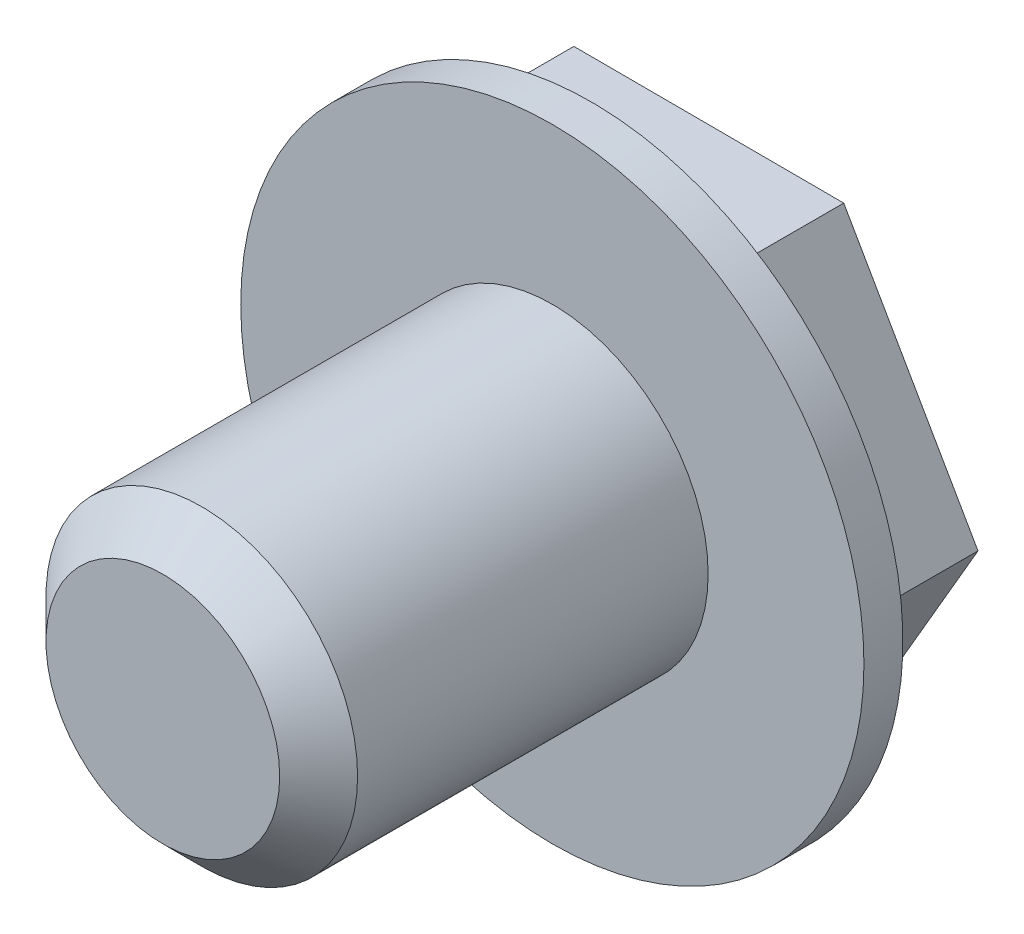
ISO-10303-21;
HEADER;
FILE_DESCRIPTION(('STEP AP214'),'2;1');
FILE_NAME('part.step','',(''),(''),'','','');
FILE_SCHEMA(('AUTOMOTIVE_DESIGN { 1 0 10303 214 1 1 1 1 }'));
ENDSEC;
DATA;
#1=APPLICATION_CONTEXT('core data for automotive mechanical design processes');
#2=APPLICATION_PROTOCOL_DEFINITION('international standard','automotive_design',2000,#1);
#3=PRODUCT_CONTEXT('',#1,'mechanical');
#4=PRODUCT('Part','Part','',(#3));
#5=PRODUCT_RELATED_PRODUCT_CATEGORY('part','',(#4));
#6=PRODUCT_DEFINITION_FORMATION('','',#4);
#7=PRODUCT_DEFINITION_CONTEXT('part definition',#1,'design');
#8=PRODUCT_DEFINITION('design','',#6,#7);
#9=PRODUCT_DEFINITION_SHAPE('','',#8);
#10=(LENGTH_UNIT() NAMED_UNIT(*) SI_UNIT(.MILLI.,.METRE.));
#11=(NAMED_UNIT(*) PLANE_ANGLE_UNIT() SI_UNIT($,.RADIAN.));
#12=(NAMED_UNIT(*) SI_UNIT($,.STERADIAN.) SOLID_ANGLE_UNIT());
#13=UNCERTAINTY_MEASURE_WITH_UNIT(LENGTH_MEASURE(1.E-05),#10,'distance_accuracy_value','');
#14=(GEOMETRIC_REPRESENTATION_CONTEXT(3) GLOBAL_UNCERTAINTY_ASSIGNED_CONTEXT((#13)) GLOBAL_UNIT_ASSIGNED_CONTEXT((#10,
#11,#12)) REPRESENTATION_CONTEXT('',''));
#15=CARTESIAN_POINT('',(0.,0.,0.));
#16=DIRECTION('',(0.,0.,1.));
#17=DIRECTION('',(1.,0.,0.));
#18=AXIS2_PLACEMENT_3D('',#15,#16,#17);
#19=CARTESIAN_POINT('',(0.,0.,7.));
#20=DIRECTION('',(0.,0.,-1.));
#21=DIRECTION('',(-1.,0.,0.));
#22=AXIS2_PLACEMENT_3D('',#19,#20,#21);
#23=CYLINDRICAL_SURFACE('',#22,4.);
#24=CARTESIAN_POINT('',(0.,0.,2.));
#25=DIRECTION('',(0.,0.,1.));
#26=DIRECTION('',(1.,0.,0.));
#27=AXIS2_PLACEMENT_3D('',#24,#25,#26);
#28=CIRCLE('',#27,4.);
#29=CARTESIAN_POINT('',(4.,0.,2.));
#30=VERTEX_POINT('',#29);
#31=EDGE_CURVE('E311',#30,#30,#28,.T.);
#32=ORIENTED_EDGE('',*,*,#31,.F.);
#33=EDGE_LOOP('',(#32));
#34=FACE_BOUND('',#33,.T.);
#35=CARTESIAN_POINT('',(0.,0.,1.5));
#36=DIRECTION('',(0.,0.,-1.));
#37=DIRECTION('',(-1.,0.,0.));
#38=AXIS2_PLACEMENT_3D('',#35,#36,#37);
#39=CIRCLE('',#38,4.);
#40=CARTESIAN_POINT('',(-4.,0.,1.5));
#41=VERTEX_POINT('',#40);
#42=EDGE_CURVE('E62',#41,#41,#39,.T.);
#43=ORIENTED_EDGE('',*,*,#42,.F.);
#44=EDGE_LOOP('',(#43));
#45=FACE_BOUND('',#44,.T.);
#46=ADVANCED_FACE('F58',(#34,#45),#23,.T.);
#47=CARTESIAN_POINT('',(0.,0.,2.));
#48=DIRECTION('',(0.,0.,1.));
#49=DIRECTION('',(1.,0.,0.));
#50=AXIS2_PLACEMENT_3D('',#47,#48,#49);
#51=PLANE('',#50);
#52=CARTESIAN_POINT('',(0.,0.,2.));
#53=DIRECTION('',(0.,0.,1.));
#54=DIRECTION('',(1.,0.,0.));
#55=AXIS2_PLACEMENT_3D('',#52,#53,#54);
#56=CIRCLE('',#55,2.);
#57=CARTESIAN_POINT('',(2.,0.,2.));
#58=VERTEX_POINT('',#57);
#59=EDGE_CURVE('E308',#58,#58,#56,.T.);
#60=ORIENTED_EDGE('',*,*,#59,.F.);
#61=EDGE_LOOP('',(#60));
#62=FACE_BOUND('',#61,.T.);
#63=ORIENTED_EDGE('',*,*,#31,.T.);
#64=EDGE_LOOP('',(#63));
#65=FACE_BOUND('',#64,.T.);
#66=ADVANCED_FACE('F333',(#62,#65),#51,.T.);
#67=CARTESIAN_POINT('',(0.,0.,2.));
#68=DIRECTION('',(0.,0.,1.));
#69=DIRECTION('',(1.,0.,0.));
#70=AXIS2_PLACEMENT_3D('',#67,#68,#69);
#71=CYLINDRICAL_SURFACE('',#70,2.);
#72=CARTESIAN_POINT('',(0.,0.,6.5));
#73=DIRECTION('',(0.,0.,1.));
#74=DIRECTION('',(1.,0.,0.));
#75=AXIS2_PLACEMENT_3D('',#72,#73,#74);
#76=CIRCLE('',#75,2.);
#77=CARTESIAN_POINT('',(2.,0.,6.5));
#78=VERTEX_POINT('',#77);
#79=EDGE_CURVE('E13',#78,#78,#76,.F.);
#80=ORIENTED_EDGE('',*,*,#79,.T.);
#81=EDGE_LOOP('',(#80));
#82=FACE_BOUND('',#81,.T.);
#83=ORIENTED_EDGE('',*,*,#59,.T.);
#84=EDGE_LOOP('',(#83));
#85=FACE_BOUND('',#84,.T.);
#86=ADVANCED_FACE('F329',(#82,#85),#71,.T.);
#87=CARTESIAN_POINT('',(0.,0.,7.));
#88=DIRECTION('',(0.,0.,1.));
#89=DIRECTION('',(1.,0.,0.));
#90=AXIS2_PLACEMENT_3D('',#87,#88,#89);
#91=PLANE('',#90);
#92=CARTESIAN_POINT('',(0.,0.,7.));
#93=DIRECTION('',(0.,0.,1.));
#94=DIRECTION('',(1.,0.,0.));
#95=AXIS2_PLACEMENT_3D('',#92,#93,#94);
#96=CIRCLE('',#95,1.5);
#97=CARTESIAN_POINT('',(1.5,0.,7.));
#98=VERTEX_POINT('',#97);
#99=EDGE_CURVE('E67',#98,#98,#96,.T.);
#100=ORIENTED_EDGE('',*,*,#99,.T.);
#101=EDGE_LOOP('',(#100));
#102=FACE_BOUND('',#101,.T.);
#103=ADVANCED_FACE('F317',(#102),#91,.T.);
#104=CARTESIAN_POINT('',(0.,0.,7.));
#105=DIRECTION('',(0.,0.,-1.));
#106=DIRECTION('',(-1.,0.,0.));
#107=AXIS2_PLACEMENT_3D('',#104,#105,#106);
#108=CONICAL_SURFACE('',#107,1.5,0.785398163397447);
#109=ORIENTED_EDGE('',*,*,#79,.F.);
#110=EDGE_LOOP('',(#109));
#111=FACE_BOUND('',#110,.T.);
#112=ORIENTED_EDGE('',*,*,#99,.F.);
#113=EDGE_LOOP('',(#112));
#114=FACE_BOUND('',#113,.T.);
#115=ADVANCED_FACE('F60',(#111,#114),#108,.T.);
#116=CARTESIAN_POINT('',(-0.295481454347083,0.,1.5));
#117=DIRECTION('',(0.,0.,-1.));
#118=DIRECTION('',(-1.,0.,0.));
#119=AXIS2_PLACEMENT_3D('',#116,#117,#118);
#120=PLANE('',#119);
#121=DIRECTION('',(-0.50249201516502,-0.864581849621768,0.));
#122=VECTOR('',#121,1.);
#123=CARTESIAN_POINT('',(3.46408724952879,-0.00997635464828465,1.5));
#124=LINE('',#123,#122);
#125=CARTESIAN_POINT('',(3.46408724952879,-0.00997635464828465,1.5));
#126=VERTEX_POINT('',#125);
#127=CARTESIAN_POINT('',(1.72340384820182,-3.00497573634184,1.5));
#128=VERTEX_POINT('',#127);
#129=EDGE_CURVE('E279',#126,#128,#124,.T.);
#130=ORIENTED_EDGE('',*,*,#129,.F.);
#131=DIRECTION('',(0.497503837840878,-0.867461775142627,0.));
#132=VECTOR('',#131,1.);
#133=CARTESIAN_POINT('',(1.74068340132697,2.99499938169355,1.5));
#134=LINE('',#133,#132);
#135=CARTESIAN_POINT('',(1.74068340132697,2.99499938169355,1.5));
#136=VERTEX_POINT('',#135);
#137=EDGE_CURVE('E276',#136,#126,#134,.T.);
#138=ORIENTED_EDGE('',*,*,#137,.F.);
#139=DIRECTION('',(0.999995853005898,-0.00287992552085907,0.));
#140=VECTOR('',#139,1.);
#141=CARTESIAN_POINT('',(-1.72340384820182,3.00497573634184,1.5));
#142=LINE('',#141,#140);
#143=CARTESIAN_POINT('',(-1.72340384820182,3.00497573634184,1.5));
#144=VERTEX_POINT('',#143);
#145=EDGE_CURVE('E273',#144,#136,#142,.T.);
#146=ORIENTED_EDGE('',*,*,#145,.F.);
#147=DIRECTION('',(0.50249201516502,0.864581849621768,0.));
#148=VECTOR('',#147,1.);
#149=CARTESIAN_POINT('',(-3.46408724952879,0.00997635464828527,1.5));
#150=LINE('',#149,#148);
#151=CARTESIAN_POINT('',(-3.46408724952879,0.00997635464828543,1.5));
#152=VERTEX_POINT('',#151);
#153=EDGE_CURVE('E270',#152,#144,#150,.T.);
#154=ORIENTED_EDGE('',*,*,#153,.F.);
#155=DIRECTION('',(-0.497503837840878,0.867461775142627,0.));
#156=VECTOR('',#155,1.);
#157=CARTESIAN_POINT('',(-1.74068340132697,-2.99499938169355,1.5));
#158=LINE('',#157,#156);
#159=CARTESIAN_POINT('',(-1.74068340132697,-2.99499938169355,1.5));
#160=VERTEX_POINT('',#159);
#161=EDGE_CURVE('E266',#160,#152,#158,.T.);
#162=ORIENTED_EDGE('',*,*,#161,.F.);
#163=DIRECTION('',(-0.999995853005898,0.0028799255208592,0.));
#164=VECTOR('',#163,1.);
#165=CARTESIAN_POINT('',(1.72340384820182,-3.00497573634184,1.5));
#166=LINE('',#165,#164);
#167=EDGE_CURVE('E263',#128,#160,#166,.T.);
#168=ORIENTED_EDGE('',*,*,#167,.F.);
#169=EDGE_LOOP('',(#130,#138,#146,#154,#162,#168));
#170=FACE_BOUND('',#169,.T.);
#171=ORIENTED_EDGE('',*,*,#42,.T.);
#172=EDGE_LOOP('',(#171));
#173=FACE_BOUND('',#172,.T.);
#174=ADVANCED_FACE('F320',(#170,#173),#120,.T.);
#175=CARTESIAN_POINT('',(1.72340384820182,-3.00497573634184,1.5));
#176=DIRECTION('',(-0.0028799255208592,-0.999995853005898,0.));
#177=DIRECTION('',(0.999995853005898,-0.0028799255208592,0.));
#178=AXIS2_PLACEMENT_3D('',#175,#176,#177);
#179=PLANE('',#178);
#180=DIRECTION('',(-0.999995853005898,0.0028799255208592,0.));
#181=VECTOR('',#180,1.);
#182=CARTESIAN_POINT('',(1.72340384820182,-3.00497573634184,0.));
#183=LINE('',#182,#181);
#184=CARTESIAN_POINT('',(1.72340384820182,-3.00497573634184,0.));
#185=VERTEX_POINT('',#184);
#186=CARTESIAN_POINT('',(-1.74068340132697,-2.99499938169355,0.));
#187=VERTEX_POINT('',#186);
#188=EDGE_CURVE('E262',#185,#187,#183,.T.);
#189=ORIENTED_EDGE('',*,*,#188,.F.);
#190=DIRECTION('',(0.,0.,-1.));
#191=VECTOR('',#190,1.);
#192=CARTESIAN_POINT('',(1.72340384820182,-3.00497573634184,1.5));
#193=LINE('',#192,#191);
#194=EDGE_CURVE('E297',#128,#185,#193,.T.);
#195=ORIENTED_EDGE('',*,*,#194,.F.);
#196=ORIENTED_EDGE('',*,*,#167,.T.);
#197=DIRECTION('',(0.,0.,-1.));
#198=VECTOR('',#197,1.);
#199=CARTESIAN_POINT('',(-1.74068340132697,-2.99499938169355,1.5));
#200=LINE('',#199,#198);
#201=EDGE_CURVE('E282',#160,#187,#200,.T.);
#202=ORIENTED_EDGE('',*,*,#201,.T.);
#203=EDGE_LOOP('',(#189,#195,#196,#202));
#204=FACE_BOUND('',#203,.T.);
#205=ADVANCED_FACE('F326',(#204),#179,.T.);
#206=CARTESIAN_POINT('',(3.46408724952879,-0.00997635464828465,1.5));
#207=DIRECTION('',(0.864581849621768,-0.50249201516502,0.));
#208=DIRECTION('',(0.50249201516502,0.864581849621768,0.));
#209=AXIS2_PLACEMENT_3D('',#206,#207,#208);
#210=PLANE('',#209);
#211=DIRECTION('',(-0.50249201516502,-0.864581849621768,0.));
#212=VECTOR('',#211,1.);
#213=CARTESIAN_POINT('',(3.46408724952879,-0.00997635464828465,0.));
#214=LINE('',#213,#212);
#215=CARTESIAN_POINT('',(3.46408724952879,-0.00997635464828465,0.));
#216=VERTEX_POINT('',#215);
#217=EDGE_CURVE('E267',#216,#185,#214,.T.);
#218=ORIENTED_EDGE('',*,*,#217,.F.);
#219=DIRECTION('',(0.,0.,-1.));
#220=VECTOR('',#219,1.);
#221=CARTESIAN_POINT('',(3.46408724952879,-0.00997635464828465,1.5));
#222=LINE('',#221,#220);
#223=EDGE_CURVE('E299',#126,#216,#222,.T.);
#224=ORIENTED_EDGE('',*,*,#223,.F.);
#225=ORIENTED_EDGE('',*,*,#129,.T.);
#226=ORIENTED_EDGE('',*,*,#194,.T.);
#227=EDGE_LOOP('',(#218,#224,#225,#226));
#228=FACE_BOUND('',#227,.T.);
#229=ADVANCED_FACE('F354',(#228),#210,.T.);
#230=CARTESIAN_POINT('',(1.74068340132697,2.99499938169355,1.5));
#231=DIRECTION('',(0.867461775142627,0.497503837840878,0.));
#232=DIRECTION('',(-0.497503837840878,0.867461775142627,0.));
#233=AXIS2_PLACEMENT_3D('',#230,#231,#232);
#234=PLANE('',#233);
#235=DIRECTION('',(0.497503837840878,-0.867461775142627,0.));
#236=VECTOR('',#235,1.);
#237=CARTESIAN_POINT('',(1.74068340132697,2.99499938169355,0.));
#238=LINE('',#237,#236);
#239=CARTESIAN_POINT('',(1.74068340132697,2.99499938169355,0.));
#240=VERTEX_POINT('',#239);
#241=EDGE_CURVE('E292',#240,#216,#238,.T.);
#242=ORIENTED_EDGE('',*,*,#241,.F.);
#243=DIRECTION('',(0.,0.,-1.));
#244=VECTOR('',#243,1.);
#245=CARTESIAN_POINT('',(1.74068340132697,2.99499938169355,1.5));
#246=LINE('',#245,#244);
#247=EDGE_CURVE('E301',#136,#240,#246,.T.);
#248=ORIENTED_EDGE('',*,*,#247,.F.);
#249=ORIENTED_EDGE('',*,*,#137,.T.);
#250=ORIENTED_EDGE('',*,*,#223,.T.);
#251=EDGE_LOOP('',(#242,#248,#249,#250));
#252=FACE_BOUND('',#251,.T.);
#253=ADVANCED_FACE('F365',(#252),#234,.T.);
#254=CARTESIAN_POINT('',(-1.72340384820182,3.00497573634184,1.5));
#255=DIRECTION('',(0.00287992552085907,0.999995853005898,0.));
#256=DIRECTION('',(-0.999995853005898,0.00287992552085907,0.));
#257=AXIS2_PLACEMENT_3D('',#254,#255,#256);
#258=PLANE('',#257);
#259=DIRECTION('',(0.999995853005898,-0.00287992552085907,0.));
#260=VECTOR('',#259,1.);
#261=CARTESIAN_POINT('',(-1.72340384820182,3.00497573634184,0.));
#262=LINE('',#261,#260);
#263=CARTESIAN_POINT('',(-1.72340384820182,3.00497573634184,0.));
#264=VERTEX_POINT('',#263);
#265=EDGE_CURVE('E289',#264,#240,#262,.T.);
#266=ORIENTED_EDGE('',*,*,#265,.F.);
#267=DIRECTION('',(0.,0.,-1.));
#268=VECTOR('',#267,1.);
#269=CARTESIAN_POINT('',(-1.72340384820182,3.00497573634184,1.5));
#270=LINE('',#269,#268);
#271=EDGE_CURVE('E303',#144,#264,#270,.T.);
#272=ORIENTED_EDGE('',*,*,#271,.F.);
#273=ORIENTED_EDGE('',*,*,#145,.T.);
#274=ORIENTED_EDGE('',*,*,#247,.T.);
#275=EDGE_LOOP('',(#266,#272,#273,#274));
#276=FACE_BOUND('',#275,.T.);
#277=ADVANCED_FACE('F362',(#276),#258,.T.);
#278=CARTESIAN_POINT('',(-3.46408724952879,0.00997635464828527,1.5));
#279=DIRECTION('',(-0.864581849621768,0.50249201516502,0.));
#280=DIRECTION('',(-0.50249201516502,-0.864581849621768,0.));
#281=AXIS2_PLACEMENT_3D('',#278,#279,#280);
#282=PLANE('',#281);
#283=DIRECTION('',(0.50249201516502,0.864581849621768,0.));
#284=VECTOR('',#283,1.);
#285=CARTESIAN_POINT('',(-3.46408724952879,0.00997635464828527,0.));
#286=LINE('',#285,#284);
#287=CARTESIAN_POINT('',(-3.46408724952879,0.00997635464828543,0.));
#288=VERTEX_POINT('',#287);
#289=EDGE_CURVE('E82',#288,#264,#286,.T.);
#290=ORIENTED_EDGE('',*,*,#289,.F.);
#291=DIRECTION('',(0.,0.,-1.));
#292=VECTOR('',#291,1.);
#293=CARTESIAN_POINT('',(-3.46408724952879,0.00997635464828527,1.5));
#294=LINE('',#293,#292);
#295=EDGE_CURVE('E305',#152,#288,#294,.T.);
#296=ORIENTED_EDGE('',*,*,#295,.F.);
#297=ORIENTED_EDGE('',*,*,#153,.T.);
#298=ORIENTED_EDGE('',*,*,#271,.T.);
#299=EDGE_LOOP('',(#290,#296,#297,#298));
#300=FACE_BOUND('',#299,.T.);
#301=ADVANCED_FACE('F358',(#300),#282,.T.);
#302=CARTESIAN_POINT('',(-1.74068340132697,-2.99499938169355,1.5));
#303=DIRECTION('',(-0.867461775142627,-0.497503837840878,0.));
#304=DIRECTION('',(0.497503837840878,-0.867461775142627,0.));
#305=AXIS2_PLACEMENT_3D('',#302,#303,#304);
#306=PLANE('',#305);
#307=DIRECTION('',(-0.497503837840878,0.867461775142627,0.));
#308=VECTOR('',#307,1.);
#309=CARTESIAN_POINT('',(-1.74068340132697,-2.99499938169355,0.));
#310=LINE('',#309,#308);
#311=EDGE_CURVE('E285',#187,#288,#310,.T.);
#312=ORIENTED_EDGE('',*,*,#311,.F.);
#313=ORIENTED_EDGE('',*,*,#201,.F.);
#314=ORIENTED_EDGE('',*,*,#161,.T.);
#315=ORIENTED_EDGE('',*,*,#295,.T.);
#316=EDGE_LOOP('',(#312,#313,#314,#315));
#317=FACE_BOUND('',#316,.T.);
#318=ADVANCED_FACE('F346',(#317),#306,.T.);
#319=CARTESIAN_POINT('',(0.,0.,0.));
#320=DIRECTION('',(0.,0.,1.));
#321=DIRECTION('',(1.,0.,0.));
#322=AXIS2_PLACEMENT_3D('',#319,#320,#321);
#323=PLANE('',#322);
#324=DIRECTION('',(0.,-1.,0.));
#325=VECTOR('',#324,1.);
#326=CARTESIAN_POINT('',(0.5,2.,0.));
#327=LINE('',#326,#325);
#328=CARTESIAN_POINT('',(0.5,-0.5,0.));
#329=VERTEX_POINT('',#328);
#330=CARTESIAN_POINT('',(0.499999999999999,-2.,0.));
#331=VERTEX_POINT('',#330);
#332=EDGE_CURVE('E424',#329,#331,#327,.T.);
#333=ORIENTED_EDGE('',*,*,#332,.F.);
#334=DIRECTION('',(-1.,0.,0.));
#335=VECTOR('',#334,1.);
#336=CARTESIAN_POINT('',(2.,-0.5,0.));
#337=LINE('',#336,#335);
#338=CARTESIAN_POINT('',(2.,-0.5,0.));
#339=VERTEX_POINT('',#338);
#340=EDGE_CURVE('E239',#339,#329,#337,.T.);
#341=ORIENTED_EDGE('',*,*,#340,.F.);
#342=DIRECTION('',(0.,-1.,0.));
#343=VECTOR('',#342,1.);
#344=CARTESIAN_POINT('',(2.,0.5,0.));
#345=LINE('',#344,#343);
#346=CARTESIAN_POINT('',(2.,0.5,0.));
#347=VERTEX_POINT('',#346);
#348=EDGE_CURVE('E235',#347,#339,#345,.T.);
#349=ORIENTED_EDGE('',*,*,#348,.F.);
#350=DIRECTION('',(-1.,0.,0.));
#351=VECTOR('',#350,1.);
#352=CARTESIAN_POINT('',(2.,0.5,0.));
#353=LINE('',#352,#351);
#354=CARTESIAN_POINT('',(0.5,0.5,0.));
#355=VERTEX_POINT('',#354);
#356=EDGE_CURVE('E224',#347,#355,#353,.T.);
#357=ORIENTED_EDGE('',*,*,#356,.T.);
#358=CARTESIAN_POINT('',(0.5,2.,0.));
#359=VERTEX_POINT('',#358);
#360=EDGE_CURVE('E206',#359,#355,#327,.T.);
#361=ORIENTED_EDGE('',*,*,#360,.F.);
#362=DIRECTION('',(-1.,0.,0.));
#363=VECTOR('',#362,1.);
#364=CARTESIAN_POINT('',(0.5,2.,0.));
#365=LINE('',#364,#363);
#366=CARTESIAN_POINT('',(-0.5,2.,0.));
#367=VERTEX_POINT('',#366);
#368=EDGE_CURVE('E250',#359,#367,#365,.T.);
#369=ORIENTED_EDGE('',*,*,#368,.T.);
#370=DIRECTION('',(0.,-1.,0.));
#371=VECTOR('',#370,1.);
#372=CARTESIAN_POINT('',(-0.5,2.,0.));
#373=LINE('',#372,#371);
#374=CARTESIAN_POINT('',(-0.5,0.5,0.));
#375=VERTEX_POINT('',#374);
#376=EDGE_CURVE('E210',#367,#375,#373,.T.);
#377=ORIENTED_EDGE('',*,*,#376,.T.);
#378=CARTESIAN_POINT('',(-2.,0.5,0.));
#379=VERTEX_POINT('',#378);
#380=EDGE_CURVE('E245',#375,#379,#353,.T.);
#381=ORIENTED_EDGE('',*,*,#380,.T.);
#382=DIRECTION('',(0.,-1.,0.));
#383=VECTOR('',#382,1.);
#384=CARTESIAN_POINT('',(-2.,0.5,0.));
#385=LINE('',#384,#383);
#386=CARTESIAN_POINT('',(-2.,-0.5,0.));
#387=VERTEX_POINT('',#386);
#388=EDGE_CURVE('E242',#379,#387,#385,.T.);
#389=ORIENTED_EDGE('',*,*,#388,.T.);
#390=CARTESIAN_POINT('',(-0.5,-0.5,0.));
#391=VERTEX_POINT('',#390);
#392=EDGE_CURVE('E238',#391,#387,#337,.T.);
#393=ORIENTED_EDGE('',*,*,#392,.F.);
#394=CARTESIAN_POINT('',(-0.500000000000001,-2.,0.));
#395=VERTEX_POINT('',#394);
#396=EDGE_CURVE('E74',#391,#395,#373,.T.);
#397=ORIENTED_EDGE('',*,*,#396,.T.);
#398=DIRECTION('',(-1.,0.,0.));
#399=VECTOR('',#398,1.);
#400=CARTESIAN_POINT('',(0.499999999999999,-2.,0.));
#401=LINE('',#400,#399);
#402=EDGE_CURVE('E421',#331,#395,#401,.T.);
#403=ORIENTED_EDGE('',*,*,#402,.F.);
#404=EDGE_LOOP('',(#333,#341,#349,#357,#361,#369,#377,#381,#389,#393,#397,#403));
#405=FACE_BOUND('',#404,.T.);
#406=ORIENTED_EDGE('',*,*,#188,.T.);
#407=ORIENTED_EDGE('',*,*,#311,.T.);
#408=ORIENTED_EDGE('',*,*,#289,.T.);
#409=ORIENTED_EDGE('',*,*,#265,.T.);
#410=ORIENTED_EDGE('',*,*,#241,.T.);
#411=ORIENTED_EDGE('',*,*,#217,.T.);
#412=EDGE_LOOP('',(#406,#407,#408,#409,#410,#411));
#413=FACE_BOUND('',#412,.T.);
#414=ADVANCED_FACE('F343',(#405,#413),#323,.F.);
#415=CARTESIAN_POINT('',(0.499999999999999,-2.,1.));
#416=DIRECTION('',(0.,-1.,0.));
#417=DIRECTION('',(0.,0.,-1.));
#418=AXIS2_PLACEMENT_3D('',#415,#416,#417);
#419=PLANE('',#418);
#420=ORIENTED_EDGE('',*,*,#402,.T.);
#421=DIRECTION('',(0.,0.,-1.));
#422=VECTOR('',#421,1.);
#423=CARTESIAN_POINT('',(-0.500000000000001,-2.,1.));
#424=LINE('',#423,#422);
#425=CARTESIAN_POINT('',(-0.500000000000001,-2.,1.));
#426=VERTEX_POINT('',#425);
#427=EDGE_CURVE('E212',#426,#395,#424,.T.);
#428=ORIENTED_EDGE('',*,*,#427,.F.);
#429=DIRECTION('',(-1.,0.,0.));
#430=VECTOR('',#429,1.);
#431=CARTESIAN_POINT('',(0.499999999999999,-2.,1.));
#432=LINE('',#431,#430);
#433=CARTESIAN_POINT('',(0.499999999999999,-2.,1.));
#434=VERTEX_POINT('',#433);
#435=EDGE_CURVE('E196',#434,#426,#432,.T.);
#436=ORIENTED_EDGE('',*,*,#435,.F.);
#437=DIRECTION('',(0.,0.,-1.));
#438=VECTOR('',#437,1.);
#439=CARTESIAN_POINT('',(0.499999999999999,-2.,1.));
#440=LINE('',#439,#438);
#441=EDGE_CURVE('E216',#434,#331,#440,.T.);
#442=ORIENTED_EDGE('',*,*,#441,.T.);
#443=EDGE_LOOP('',(#420,#428,#436,#442));
#444=FACE_BOUND('',#443,.T.);
#445=ADVANCED_FACE('F345',(#444),#419,.F.);
#446=CARTESIAN_POINT('',(0.5,2.,1.));
#447=DIRECTION('',(1.,0.,0.));
#448=DIRECTION('',(0.,1.,0.));
#449=AXIS2_PLACEMENT_3D('',#446,#447,#448);
#450=PLANE('',#449);
#451=DIRECTION('',(0.,0.,-1.));
#452=VECTOR('',#451,1.);
#453=CARTESIAN_POINT('',(0.5,-0.5,1.));
#454=LINE('',#453,#452);
#455=CARTESIAN_POINT('',(0.5,-0.5,1.));
#456=VERTEX_POINT('',#455);
#457=EDGE_CURVE('E211',#456,#329,#454,.T.);
#458=ORIENTED_EDGE('',*,*,#457,.T.);
#459=ORIENTED_EDGE('',*,*,#332,.T.);
#460=ORIENTED_EDGE('',*,*,#441,.F.);
#461=DIRECTION('',(0.,-1.,0.));
#462=VECTOR('',#461,1.);
#463=CARTESIAN_POINT('',(0.5,2.,1.));
#464=LINE('',#463,#462);
#465=EDGE_CURVE('E414',#456,#434,#464,.T.);
#466=ORIENTED_EDGE('',*,*,#465,.F.);
#467=EDGE_LOOP('',(#458,#459,#460,#466));
#468=FACE_BOUND('',#467,.T.);
#469=ADVANCED_FACE('F397',(#468),#450,.F.);
#470=CARTESIAN_POINT('',(-0.5,2.,1.));
#471=DIRECTION('',(1.,0.,0.));
#472=DIRECTION('',(0.,1.,0.));
#473=AXIS2_PLACEMENT_3D('',#470,#471,#472);
#474=PLANE('',#473);
#475=DIRECTION('',(0.,-1.,0.));
#476=VECTOR('',#475,1.);
#477=CARTESIAN_POINT('',(-0.5,2.,1.));
#478=LINE('',#477,#476);
#479=CARTESIAN_POINT('',(-0.5,-0.5,1.));
#480=VERTEX_POINT('',#479);
#481=EDGE_CURVE('E197',#480,#426,#478,.T.);
#482=ORIENTED_EDGE('',*,*,#481,.T.);
#483=ORIENTED_EDGE('',*,*,#427,.T.);
#484=ORIENTED_EDGE('',*,*,#396,.F.);
#485=DIRECTION('',(0.,0.,-1.));
#486=VECTOR('',#485,1.);
#487=CARTESIAN_POINT('',(-0.5,-0.5,1.));
#488=LINE('',#487,#486);
#489=EDGE_CURVE('E257',#480,#391,#488,.T.);
#490=ORIENTED_EDGE('',*,*,#489,.F.);
#491=EDGE_LOOP('',(#482,#483,#484,#490));
#492=FACE_BOUND('',#491,.T.);
#493=ADVANCED_FACE('F394',(#492),#474,.T.);
#494=CARTESIAN_POINT('',(0.,0.,1.));
#495=DIRECTION('',(0.,0.,1.));
#496=DIRECTION('',(1.,0.,0.));
#497=AXIS2_PLACEMENT_3D('',#494,#495,#496);
#498=PLANE('',#497);
#499=ORIENTED_EDGE('',*,*,#465,.T.);
#500=ORIENTED_EDGE('',*,*,#435,.T.);
#501=ORIENTED_EDGE('',*,*,#481,.F.);
#502=DIRECTION('',(-1.,0.,0.));
#503=VECTOR('',#502,1.);
#504=CARTESIAN_POINT('',(2.,-0.5,1.));
#505=LINE('',#504,#503);
#506=CARTESIAN_POINT('',(-2.,-0.5,1.));
#507=VERTEX_POINT('',#506);
#508=EDGE_CURVE('E223',#480,#507,#505,.T.);
#509=ORIENTED_EDGE('',*,*,#508,.T.);
#510=DIRECTION('',(0.,-1.,0.));
#511=VECTOR('',#510,1.);
#512=CARTESIAN_POINT('',(-2.,0.5,1.));
#513=LINE('',#512,#511);
#514=CARTESIAN_POINT('',(-2.,0.5,1.));
#515=VERTEX_POINT('',#514);
#516=EDGE_CURVE('E228',#515,#507,#513,.T.);
#517=ORIENTED_EDGE('',*,*,#516,.F.);
#518=DIRECTION('',(-1.,0.,0.));
#519=VECTOR('',#518,1.);
#520=CARTESIAN_POINT('',(2.,0.5,1.));
#521=LINE('',#520,#519);
#522=CARTESIAN_POINT('',(-0.5,0.5,1.));
#523=VERTEX_POINT('',#522);
#524=EDGE_CURVE('E193',#523,#515,#521,.T.);
#525=ORIENTED_EDGE('',*,*,#524,.F.);
#526=CARTESIAN_POINT('',(-0.5,2.,1.));
#527=VERTEX_POINT('',#526);
#528=EDGE_CURVE('E186',#527,#523,#478,.T.);
#529=ORIENTED_EDGE('',*,*,#528,.F.);
#530=DIRECTION('',(-1.,0.,0.));
#531=VECTOR('',#530,1.);
#532=CARTESIAN_POINT('',(0.5,2.,1.));
#533=LINE('',#532,#531);
#534=CARTESIAN_POINT('',(0.5,2.,1.));
#535=VERTEX_POINT('',#534);
#536=EDGE_CURVE('E190',#535,#527,#533,.T.);
#537=ORIENTED_EDGE('',*,*,#536,.F.);
#538=CARTESIAN_POINT('',(0.5,0.5,1.));
#539=VERTEX_POINT('',#538);
#540=EDGE_CURVE('E411',#535,#539,#464,.T.);
#541=ORIENTED_EDGE('',*,*,#540,.T.);
#542=CARTESIAN_POINT('',(2.,0.5,1.));
#543=VERTEX_POINT('',#542);
#544=EDGE_CURVE('E231',#543,#539,#521,.T.);
#545=ORIENTED_EDGE('',*,*,#544,.F.);
#546=DIRECTION('',(0.,-1.,0.));
#547=VECTOR('',#546,1.);
#548=CARTESIAN_POINT('',(2.,0.5,1.));
#549=LINE('',#548,#547);
#550=CARTESIAN_POINT('',(2.,-0.5,1.));
#551=VERTEX_POINT('',#550);
#552=EDGE_CURVE('E220',#543,#551,#549,.T.);
#553=ORIENTED_EDGE('',*,*,#552,.T.);
#554=EDGE_CURVE('E225',#551,#456,#505,.T.);
#555=ORIENTED_EDGE('',*,*,#554,.T.);
#556=EDGE_LOOP('',(#499,#500,#501,#509,#517,#525,#529,#537,#541,#545,#553,#555));
#557=FACE_BOUND('',#556,.T.);
#558=ADVANCED_FACE('F188',(#557),#498,.F.);
#559=ORIENTED_EDGE('',*,*,#540,.F.);
#560=DIRECTION('',(0.,0.,-1.));
#561=VECTOR('',#560,1.);
#562=CARTESIAN_POINT('',(0.5,2.,1.));
#563=LINE('',#562,#561);
#564=EDGE_CURVE('E205',#535,#359,#563,.T.);
#565=ORIENTED_EDGE('',*,*,#564,.T.);
#566=ORIENTED_EDGE('',*,*,#360,.T.);
#567=DIRECTION('',(0.,0.,-1.));
#568=VECTOR('',#567,1.);
#569=CARTESIAN_POINT('',(0.5,0.5,1.));
#570=LINE('',#569,#568);
#571=EDGE_CURVE('E214',#539,#355,#570,.T.);
#572=ORIENTED_EDGE('',*,*,#571,.F.);
#573=EDGE_LOOP('',(#559,#565,#566,#572));
#574=FACE_BOUND('',#573,.T.);
#575=ADVANCED_FACE('F393',(#574),#450,.F.);
#576=CARTESIAN_POINT('',(0.5,2.,1.));
#577=DIRECTION('',(0.,-1.,0.));
#578=DIRECTION('',(0.,0.,-1.));
#579=AXIS2_PLACEMENT_3D('',#576,#577,#578);
#580=PLANE('',#579);
#581=ORIENTED_EDGE('',*,*,#368,.F.);
#582=ORIENTED_EDGE('',*,*,#564,.F.);
#583=ORIENTED_EDGE('',*,*,#536,.T.);
#584=DIRECTION('',(0.,0.,-1.));
#585=VECTOR('',#584,1.);
#586=CARTESIAN_POINT('',(-0.5,2.,1.));
#587=LINE('',#586,#585);
#588=EDGE_CURVE('E203',#527,#367,#587,.T.);
#589=ORIENTED_EDGE('',*,*,#588,.T.);
#590=EDGE_LOOP('',(#581,#582,#583,#589));
#591=FACE_BOUND('',#590,.T.);
#592=ADVANCED_FACE('F202',(#591),#580,.T.);
#593=DIRECTION('',(0.,0.,-1.));
#594=VECTOR('',#593,1.);
#595=CARTESIAN_POINT('',(-0.5,0.5,1.));
#596=LINE('',#595,#594);
#597=EDGE_CURVE('E259',#523,#375,#596,.T.);
#598=ORIENTED_EDGE('',*,*,#597,.T.);
#599=ORIENTED_EDGE('',*,*,#376,.F.);
#600=ORIENTED_EDGE('',*,*,#588,.F.);
#601=ORIENTED_EDGE('',*,*,#528,.T.);
#602=EDGE_LOOP('',(#598,#599,#600,#601));
#603=FACE_BOUND('',#602,.T.);
#604=ADVANCED_FACE('F208',(#603),#474,.T.);
#605=CARTESIAN_POINT('',(2.,0.5,1.));
#606=DIRECTION('',(1.,0.,0.));
#607=DIRECTION('',(0.,0.,-1.));
#608=AXIS2_PLACEMENT_3D('',#605,#606,#607);
#609=PLANE('',#608);
#610=ORIENTED_EDGE('',*,*,#348,.T.);
#611=DIRECTION('',(0.,0.,-1.));
#612=VECTOR('',#611,1.);
#613=CARTESIAN_POINT('',(2.,-0.5,1.));
#614=LINE('',#613,#612);
#615=EDGE_CURVE('E234',#551,#339,#614,.T.);
#616=ORIENTED_EDGE('',*,*,#615,.F.);
#617=ORIENTED_EDGE('',*,*,#552,.F.);
#618=DIRECTION('',(0.,0.,-1.));
#619=VECTOR('',#618,1.);
#620=CARTESIAN_POINT('',(2.,0.5,1.));
#621=LINE('',#620,#619);
#622=EDGE_CURVE('E248',#543,#347,#621,.T.);
#623=ORIENTED_EDGE('',*,*,#622,.T.);
#624=EDGE_LOOP('',(#610,#616,#617,#623));
#625=FACE_BOUND('',#624,.T.);
#626=ADVANCED_FACE('F373',(#625),#609,.F.);
#627=CARTESIAN_POINT('',(2.,0.5,1.));
#628=DIRECTION('',(0.,-1.,0.));
#629=DIRECTION('',(0.,0.,-1.));
#630=AXIS2_PLACEMENT_3D('',#627,#628,#629);
#631=PLANE('',#630);
#632=ORIENTED_EDGE('',*,*,#571,.T.);
#633=ORIENTED_EDGE('',*,*,#356,.F.);
#634=ORIENTED_EDGE('',*,*,#622,.F.);
#635=ORIENTED_EDGE('',*,*,#544,.T.);
#636=EDGE_LOOP('',(#632,#633,#634,#635));
#637=FACE_BOUND('',#636,.T.);
#638=ADVANCED_FACE('F376',(#637),#631,.T.);
#639=CARTESIAN_POINT('',(2.,-0.5,1.));
#640=DIRECTION('',(0.,-1.,0.));
#641=DIRECTION('',(0.,0.,-1.));
#642=AXIS2_PLACEMENT_3D('',#639,#640,#641);
#643=PLANE('',#642);
#644=ORIENTED_EDGE('',*,*,#554,.F.);
#645=ORIENTED_EDGE('',*,*,#615,.T.);
#646=ORIENTED_EDGE('',*,*,#340,.T.);
#647=ORIENTED_EDGE('',*,*,#457,.F.);
#648=EDGE_LOOP('',(#644,#645,#646,#647));
#649=FACE_BOUND('',#648,.T.);
#650=ADVANCED_FACE('F378',(#649),#643,.F.);
#651=ORIENTED_EDGE('',*,*,#524,.T.);
#652=DIRECTION('',(0.,0.,-1.));
#653=VECTOR('',#652,1.);
#654=CARTESIAN_POINT('',(-2.,0.5,1.));
#655=LINE('',#654,#653);
#656=EDGE_CURVE('E251',#515,#379,#655,.T.);
#657=ORIENTED_EDGE('',*,*,#656,.T.);
#658=ORIENTED_EDGE('',*,*,#380,.F.);
#659=ORIENTED_EDGE('',*,*,#597,.F.);
#660=EDGE_LOOP('',(#651,#657,#658,#659));
#661=FACE_BOUND('',#660,.T.);
#662=ADVANCED_FACE('F381',(#661),#631,.T.);
#663=CARTESIAN_POINT('',(-2.,0.5,1.));
#664=DIRECTION('',(1.,0.,0.));
#665=DIRECTION('',(0.,1.,0.));
#666=AXIS2_PLACEMENT_3D('',#663,#664,#665);
#667=PLANE('',#666);
#668=ORIENTED_EDGE('',*,*,#388,.F.);
#669=ORIENTED_EDGE('',*,*,#656,.F.);
#670=ORIENTED_EDGE('',*,*,#516,.T.);
#671=DIRECTION('',(0.,0.,-1.));
#672=VECTOR('',#671,1.);
#673=CARTESIAN_POINT('',(-2.,-0.5,1.));
#674=LINE('',#673,#672);
#675=EDGE_CURVE('E253',#507,#387,#674,.T.);
#676=ORIENTED_EDGE('',*,*,#675,.T.);
#677=EDGE_LOOP('',(#668,#669,#670,#676));
#678=FACE_BOUND('',#677,.T.);
#679=ADVANCED_FACE('F384',(#678),#667,.T.);
#680=ORIENTED_EDGE('',*,*,#489,.T.);
#681=ORIENTED_EDGE('',*,*,#392,.T.);
#682=ORIENTED_EDGE('',*,*,#675,.F.);
#683=ORIENTED_EDGE('',*,*,#508,.F.);
#684=EDGE_LOOP('',(#680,#681,#682,#683));
#685=FACE_BOUND('',#684,.T.);
#686=ADVANCED_FACE('F383',(#685),#643,.F.);
#687=CLOSED_SHELL('',(#46,#66,#86,#103,#115,#174,#205,#229,#253,#277,#301,#318,#414,#445,#469,
#493,#558,#575,#592,#604,#626,#638,#650,#662,#679,#686));
#688=MANIFOLD_SOLID_BREP('B2',#687);
#689=ADVANCED_BREP_SHAPE_REPRESENTATION('',(#18,#688),#14);
#690=SHAPE_DEFINITION_REPRESENTATION(#9,#689);
ENDSEC;
END-ISO-10303-21;
